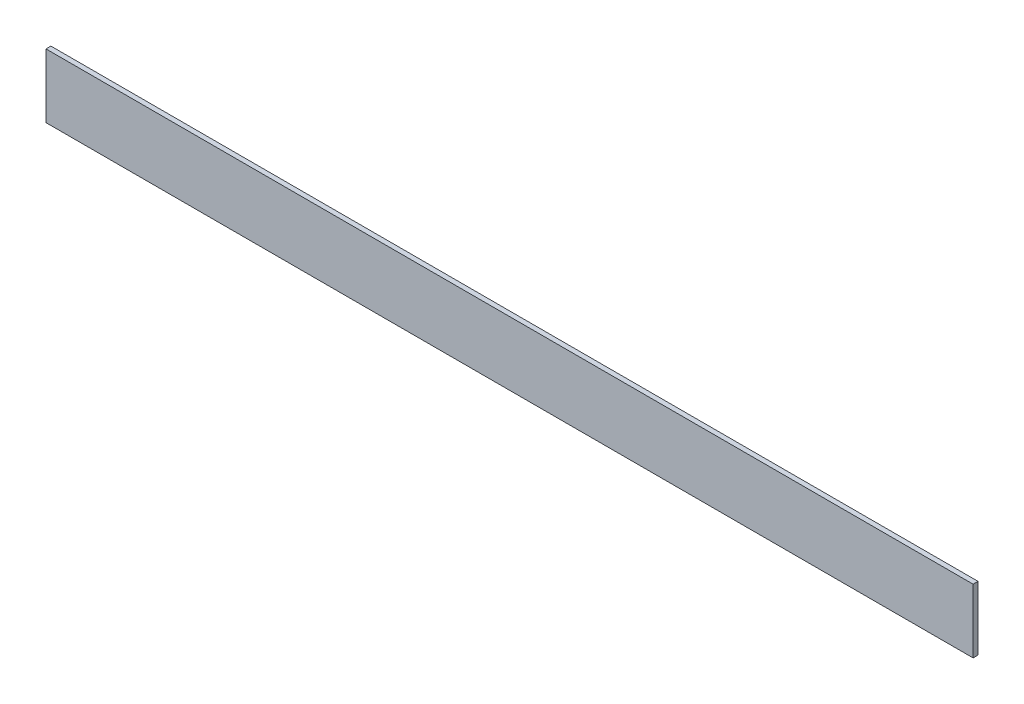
ISO-10303-21;
HEADER;
FILE_DESCRIPTION(('STEP AP214'),'2;1');
FILE_NAME('part.step','',(''),(''),'','','');
FILE_SCHEMA(('AUTOMOTIVE_DESIGN { 1 0 10303 214 1 1 1 1 }'));
ENDSEC;
DATA;
#1=APPLICATION_CONTEXT('core data for automotive mechanical design processes');
#2=APPLICATION_PROTOCOL_DEFINITION('international standard','automotive_design',2000,#1);
#3=PRODUCT_CONTEXT('',#1,'mechanical');
#4=PRODUCT('Part','Part','',(#3));
#5=PRODUCT_RELATED_PRODUCT_CATEGORY('part','',(#4));
#6=PRODUCT_DEFINITION_FORMATION('','',#4);
#7=PRODUCT_DEFINITION_CONTEXT('part definition',#1,'design');
#8=PRODUCT_DEFINITION('design','',#6,#7);
#9=PRODUCT_DEFINITION_SHAPE('','',#8);
#10=(LENGTH_UNIT() NAMED_UNIT(*) SI_UNIT(.MILLI.,.METRE.));
#11=(NAMED_UNIT(*) PLANE_ANGLE_UNIT() SI_UNIT($,.RADIAN.));
#12=(NAMED_UNIT(*) SI_UNIT($,.STERADIAN.) SOLID_ANGLE_UNIT());
#13=UNCERTAINTY_MEASURE_WITH_UNIT(LENGTH_MEASURE(1.E-05),#10,'distance_accuracy_value','');
#14=(GEOMETRIC_REPRESENTATION_CONTEXT(3) GLOBAL_UNCERTAINTY_ASSIGNED_CONTEXT((#13)) GLOBAL_UNIT_ASSIGNED_CONTEXT((#10,
#11,#12)) REPRESENTATION_CONTEXT('',''));
#15=CARTESIAN_POINT('',(0.,0.,0.));
#16=DIRECTION('',(0.,0.,1.));
#17=DIRECTION('',(1.,0.,0.));
#18=AXIS2_PLACEMENT_3D('',#15,#16,#17);
#19=CARTESIAN_POINT('',(283.,-19.5,3.));
#20=DIRECTION('',(-1.,0.,0.));
#21=DIRECTION('',(0.,0.,1.));
#22=AXIS2_PLACEMENT_3D('',#19,#20,#21);
#23=PLANE('',#22);
#24=DIRECTION('',(0.,1.,0.));
#25=VECTOR('',#24,1.);
#26=CARTESIAN_POINT('',(283.,-19.5,0.));
#27=LINE('',#26,#25);
#28=CARTESIAN_POINT('',(283.,-19.5,0.));
#29=VERTEX_POINT('',#28);
#30=CARTESIAN_POINT('',(283.,19.5,0.));
#31=VERTEX_POINT('',#30);
#32=EDGE_CURVE('E97',#29,#31,#27,.T.);
#33=ORIENTED_EDGE('',*,*,#32,.T.);
#34=DIRECTION('',(0.,0.,-1.));
#35=VECTOR('',#34,1.);
#36=CARTESIAN_POINT('',(283.,19.5,3.));
#37=LINE('',#36,#35);
#38=CARTESIAN_POINT('',(283.,19.5,3.));
#39=VERTEX_POINT('',#38);
#40=EDGE_CURVE('E11',#39,#31,#37,.T.);
#41=ORIENTED_EDGE('',*,*,#40,.F.);
#42=DIRECTION('',(0.,1.,0.));
#43=VECTOR('',#42,1.);
#44=CARTESIAN_POINT('',(283.,-19.5,3.));
#45=LINE('',#44,#43);
#46=CARTESIAN_POINT('',(283.,-19.5,3.));
#47=VERTEX_POINT('',#46);
#48=EDGE_CURVE('E85',#47,#39,#45,.T.);
#49=ORIENTED_EDGE('',*,*,#48,.F.);
#50=DIRECTION('',(0.,0.,-1.));
#51=VECTOR('',#50,1.);
#52=CARTESIAN_POINT('',(283.,-19.5,3.));
#53=LINE('',#52,#51);
#54=EDGE_CURVE('E93',#47,#29,#53,.T.);
#55=ORIENTED_EDGE('',*,*,#54,.T.);
#56=EDGE_LOOP('',(#33,#41,#49,#55));
#57=FACE_BOUND('',#56,.T.);
#58=ADVANCED_FACE('F34',(#57),#23,.F.);
#59=CARTESIAN_POINT('',(-283.,19.5,3.));
#60=DIRECTION('',(0.,-1.,0.));
#61=DIRECTION('',(0.,0.,-1.));
#62=AXIS2_PLACEMENT_3D('',#59,#60,#61);
#63=PLANE('',#62);
#64=DIRECTION('',(-1.,0.,0.));
#65=VECTOR('',#64,1.);
#66=CARTESIAN_POINT('',(-283.,19.5,0.));
#67=LINE('',#66,#65);
#68=CARTESIAN_POINT('',(-283.,19.5,0.));
#69=VERTEX_POINT('',#68);
#70=EDGE_CURVE('E89',#31,#69,#67,.T.);
#71=ORIENTED_EDGE('',*,*,#70,.T.);
#72=DIRECTION('',(0.,0.,-1.));
#73=VECTOR('',#72,1.);
#74=CARTESIAN_POINT('',(-283.,19.5,3.));
#75=LINE('',#74,#73);
#76=CARTESIAN_POINT('',(-283.,19.5,3.));
#77=VERTEX_POINT('',#76);
#78=EDGE_CURVE('E42',#77,#69,#75,.T.);
#79=ORIENTED_EDGE('',*,*,#78,.F.);
#80=DIRECTION('',(-1.,0.,0.));
#81=VECTOR('',#80,1.);
#82=CARTESIAN_POINT('',(-283.,19.5,3.));
#83=LINE('',#82,#81);
#84=EDGE_CURVE('E80',#39,#77,#83,.T.);
#85=ORIENTED_EDGE('',*,*,#84,.F.);
#86=ORIENTED_EDGE('',*,*,#40,.T.);
#87=EDGE_LOOP('',(#71,#79,#85,#86));
#88=FACE_BOUND('',#87,.T.);
#89=ADVANCED_FACE('F88',(#88),#63,.F.);
#90=CARTESIAN_POINT('',(-283.,-19.5,3.));
#91=DIRECTION('',(1.,0.,0.));
#92=DIRECTION('',(0.,0.,-1.));
#93=AXIS2_PLACEMENT_3D('',#90,#91,#92);
#94=PLANE('',#93);
#95=DIRECTION('',(0.,-1.,0.));
#96=VECTOR('',#95,1.);
#97=CARTESIAN_POINT('',(-283.,-19.5,0.));
#98=LINE('',#97,#96);
#99=CARTESIAN_POINT('',(-283.,-19.5,0.));
#100=VERTEX_POINT('',#99);
#101=EDGE_CURVE('E67',#69,#100,#98,.T.);
#102=ORIENTED_EDGE('',*,*,#101,.T.);
#103=DIRECTION('',(0.,0.,-1.));
#104=VECTOR('',#103,1.);
#105=CARTESIAN_POINT('',(-283.,-19.5,3.));
#106=LINE('',#105,#104);
#107=CARTESIAN_POINT('',(-283.,-19.5,3.));
#108=VERTEX_POINT('',#107);
#109=EDGE_CURVE('E90',#108,#100,#106,.T.);
#110=ORIENTED_EDGE('',*,*,#109,.F.);
#111=DIRECTION('',(0.,-1.,0.));
#112=VECTOR('',#111,1.);
#113=CARTESIAN_POINT('',(-283.,-19.5,3.));
#114=LINE('',#113,#112);
#115=EDGE_CURVE('E83',#77,#108,#114,.T.);
#116=ORIENTED_EDGE('',*,*,#115,.F.);
#117=ORIENTED_EDGE('',*,*,#78,.T.);
#118=EDGE_LOOP('',(#102,#110,#116,#117));
#119=FACE_BOUND('',#118,.T.);
#120=ADVANCED_FACE('F91',(#119),#94,.F.);
#121=CARTESIAN_POINT('',(-283.,-19.5,3.));
#122=DIRECTION('',(0.,1.,0.));
#123=DIRECTION('',(0.,0.,1.));
#124=AXIS2_PLACEMENT_3D('',#121,#122,#123);
#125=PLANE('',#124);
#126=DIRECTION('',(1.,0.,0.));
#127=VECTOR('',#126,1.);
#128=CARTESIAN_POINT('',(-283.,-19.5,0.));
#129=LINE('',#128,#127);
#130=EDGE_CURVE('E73',#100,#29,#129,.T.);
#131=ORIENTED_EDGE('',*,*,#130,.T.);
#132=ORIENTED_EDGE('',*,*,#54,.F.);
#133=DIRECTION('',(1.,0.,0.));
#134=VECTOR('',#133,1.);
#135=CARTESIAN_POINT('',(-283.,-19.5,3.));
#136=LINE('',#135,#134);
#137=EDGE_CURVE('E50',#108,#47,#136,.T.);
#138=ORIENTED_EDGE('',*,*,#137,.F.);
#139=ORIENTED_EDGE('',*,*,#109,.T.);
#140=EDGE_LOOP('',(#131,#132,#138,#139));
#141=FACE_BOUND('',#140,.T.);
#142=ADVANCED_FACE('F104',(#141),#125,.F.);
#143=CARTESIAN_POINT('',(0.,0.,3.));
#144=DIRECTION('',(0.,0.,-1.));
#145=DIRECTION('',(-1.,0.,0.));
#146=AXIS2_PLACEMENT_3D('',#143,#144,#145);
#147=PLANE('',#146);
#148=ORIENTED_EDGE('',*,*,#48,.T.);
#149=ORIENTED_EDGE('',*,*,#84,.T.);
#150=ORIENTED_EDGE('',*,*,#115,.T.);
#151=ORIENTED_EDGE('',*,*,#137,.T.);
#152=EDGE_LOOP('',(#148,#149,#150,#151));
#153=FACE_BOUND('',#152,.T.);
#154=ADVANCED_FACE('F81',(#153),#147,.F.);
#155=CARTESIAN_POINT('',(0.,0.,0.));
#156=DIRECTION('',(0.,0.,-1.));
#157=DIRECTION('',(-1.,0.,0.));
#158=AXIS2_PLACEMENT_3D('',#155,#156,#157);
#159=PLANE('',#158);
#160=ORIENTED_EDGE('',*,*,#32,.F.);
#161=ORIENTED_EDGE('',*,*,#130,.F.);
#162=ORIENTED_EDGE('',*,*,#101,.F.);
#163=ORIENTED_EDGE('',*,*,#70,.F.);
#164=EDGE_LOOP('',(#160,#161,#162,#163));
#165=FACE_BOUND('',#164,.T.);
#166=ADVANCED_FACE('F107',(#165),#159,.T.);
#167=CLOSED_SHELL('',(#58,#89,#120,#142,#154,#166));
#168=MANIFOLD_SOLID_BREP('B2',#167);
#169=ADVANCED_BREP_SHAPE_REPRESENTATION('',(#18,#168),#14);
#170=SHAPE_DEFINITION_REPRESENTATION(#9,#169);
ENDSEC;
END-ISO-10303-21;
